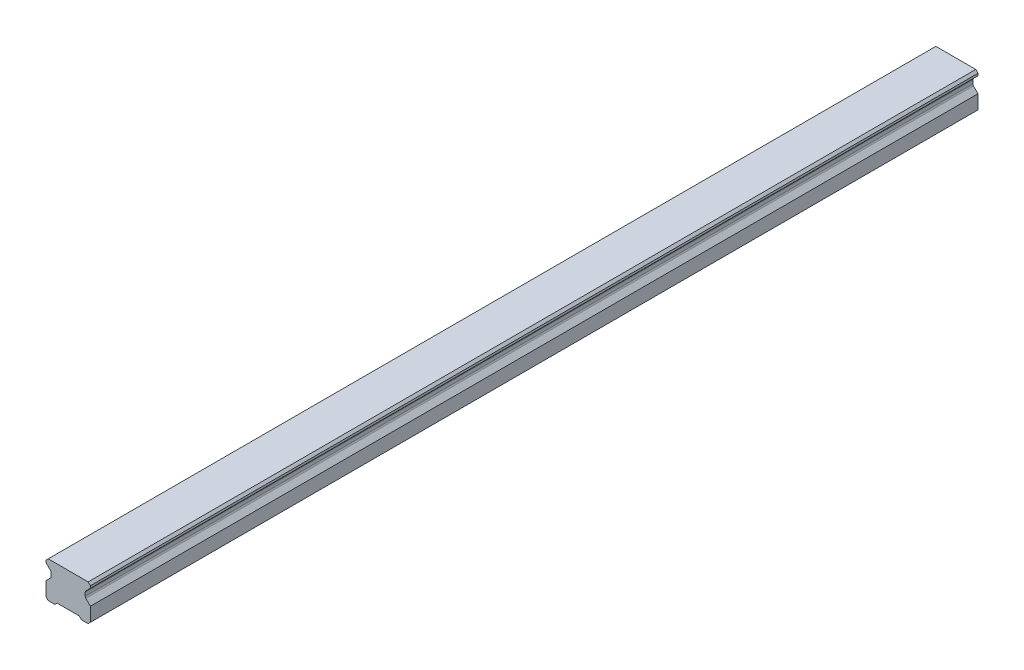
from build123d import *

# Parameters (mm, degrees)
SKETCH1_W           = 20
SKETCH1_H           = 16.3
BOSS_EXTRUDE1_DEPTH = 200
CUT_EXTRUDE1_DEPTH  = 401.456851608
CHAMFER1_SIZE       = 1
FILLET1_R           = 1
CUT_EXTRUDE2_DEPTH  = 401.456851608
SKETCH5_R           = 3
SKETCH5_R_2         = 2.5
CUT_EXTRUDE5_DEPTH  = 10
SKETCH5_2_R         = 2.5
CUT_EXTRUDE6_DEPTH  = 13
LPATTERN2_COUNT     = 7
LPATTERN2_PITCH     = 60


with BuildPart() as part:
    # Sketch1 → Boss-Extrude1 (new, symmetric)
    with BuildSketch(Plane.XY):
        with Locations((0, 8.15)):
            Rectangle(SKETCH1_W, SKETCH1_H)
    extrude(amount=BOSS_EXTRUDE1_DEPTH, both=True)

    # Sketch2 → Cut-Extrude1 (cut, through all)
    with BuildSketch(Plane.XY.offset(200)):
        Polygon((-10, 14.3), (-10, 7.3), (-7.666666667, 9.633333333), (-7.666666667, 11.966666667), align=None)
        Polygon((7.666666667, 11.966666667), (10, 14.3), (10, 7.3), (7.666666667, 9.633333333), align=None)
    extrude(amount=-CUT_EXTRUDE1_DEPTH, mode=Mode.SUBTRACT)

    # Chamfer1
    chamfer1_edges = [part.edges().sort_by_distance(p)[0] for p in [
        (-10, 16.3, 0),
        (10, 16.3, 0),
        (10, 0, 0),
        (-10, 0, 0),
    ]]
    chamfer(chamfer1_edges, length=CHAMFER1_SIZE)

    # Fillet1
    fillet1_edges = [part.edges().sort_by_distance(p)[0] for p in [
        (-7.666666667, 11.966666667, 0),
        (-7.666666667, 9.633333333, 0),
        (7.666666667, 9.633333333, 0),
        (7.666666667, 11.966666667, 0),
    ]]
    fillet(fillet1_edges, radius=FILLET1_R)

    # Sketch3 → Cut-Extrude2 (cut, through all)
    with BuildSketch(Plane.XY.offset(200)):
        Polygon((-6, 0), (-5, 1), (5, 1), (6, 0), align=None)
    extrude(amount=-CUT_EXTRUDE2_DEPTH, mode=Mode.SUBTRACT)

    # Sketch5 → Cut-Extrude5 (cut)
    with BuildSketch(Plane.XZ.offset(-1)):
        with Locations(Location((0, 180, 0), (0, 0, 270))):
            Circle(SKETCH5_R)
        with Locations(Location((0, 180, 0), (0, 0, 270))):
            Circle(SKETCH5_R_2, mode=Mode.SUBTRACT)
    cut_extrude5 = extrude(amount=-CUT_EXTRUDE5_DEPTH, mode=Mode.SUBTRACT)

    # Sketch5_2 → Cut-Extrude6 (cut)
    with BuildSketch(Plane.XZ.offset(-1)):
        with Locations(Location((0, 180, 0), (0, 0, 270))):
            Circle(SKETCH5_2_R)
    cut_extrude6 = extrude(amount=-CUT_EXTRUDE6_DEPTH, mode=Mode.SUBTRACT)

    # Cut-Extrude7 cone 1 section (on through the dimple's axis) → Cut-Extrude7 (revolve, cut)
    with BuildSketch(Plane(origin=(0, 14, 180), x_dir=(0, 0, -1), z_dir=(1, 0, 0))):
        Polygon((0, 0), (2.5, 0), (0, 1.443375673), align=None)
    cut_extrude7 = revolve(axis=Axis((0, 14, 180), (0, 1, 0)), mode=Mode.SUBTRACT)

    # LPattern2: Cut-Extrude5, Cut-Extrude6, Cut-Extrude7 ×7
    with Locations(*[(0, 0, -i * LPATTERN2_PITCH) for i in range(1, LPATTERN2_COUNT)]):
        add(cut_extrude5, mode=Mode.SUBTRACT)
        add(cut_extrude6, mode=Mode.SUBTRACT)
        add(cut_extrude7, mode=Mode.SUBTRACT)


solid = part.part
